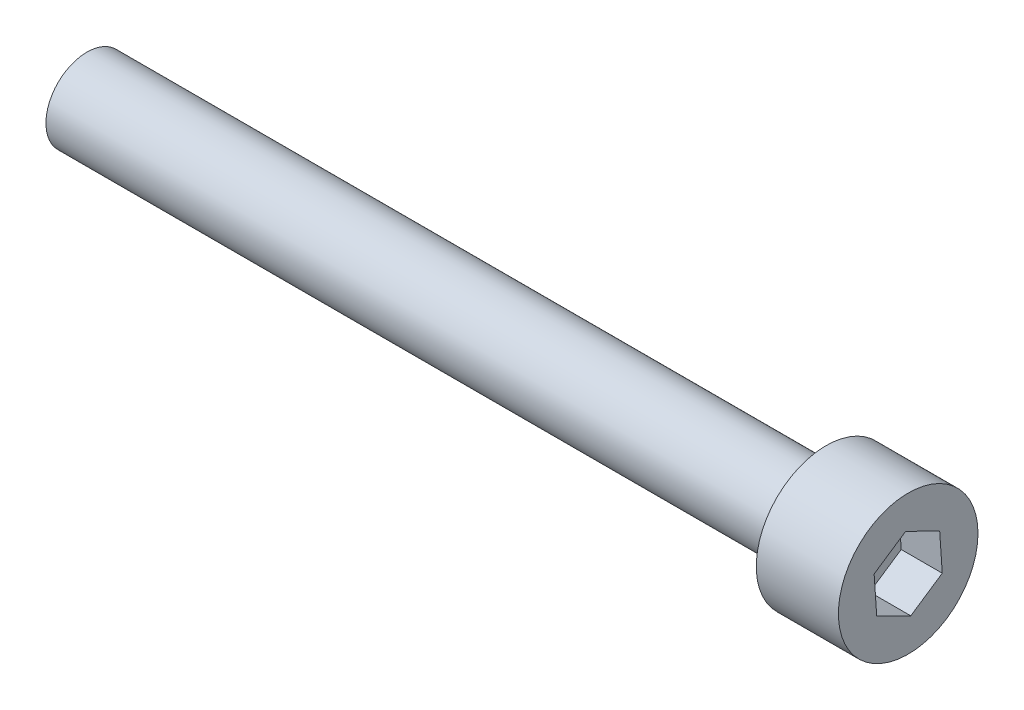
ISO-10303-21;
HEADER;
FILE_DESCRIPTION(('STEP AP214'),'2;1');
FILE_NAME('part.step','',(''),(''),'','','');
FILE_SCHEMA(('AUTOMOTIVE_DESIGN { 1 0 10303 214 1 1 1 1 }'));
ENDSEC;
DATA;
#1=APPLICATION_CONTEXT('core data for automotive mechanical design processes');
#2=APPLICATION_PROTOCOL_DEFINITION('international standard','automotive_design',2000,#1);
#3=PRODUCT_CONTEXT('',#1,'mechanical');
#4=PRODUCT('Part','Part','',(#3));
#5=PRODUCT_RELATED_PRODUCT_CATEGORY('part','',(#4));
#6=PRODUCT_DEFINITION_FORMATION('','',#4);
#7=PRODUCT_DEFINITION_CONTEXT('part definition',#1,'design');
#8=PRODUCT_DEFINITION('design','',#6,#7);
#9=PRODUCT_DEFINITION_SHAPE('','',#8);
#10=(LENGTH_UNIT() NAMED_UNIT(*) SI_UNIT(.MILLI.,.METRE.));
#11=(NAMED_UNIT(*) PLANE_ANGLE_UNIT() SI_UNIT($,.RADIAN.));
#12=(NAMED_UNIT(*) SI_UNIT($,.STERADIAN.) SOLID_ANGLE_UNIT());
#13=UNCERTAINTY_MEASURE_WITH_UNIT(LENGTH_MEASURE(1.E-05),#10,'distance_accuracy_value','');
#14=(GEOMETRIC_REPRESENTATION_CONTEXT(3) GLOBAL_UNCERTAINTY_ASSIGNED_CONTEXT((#13)) GLOBAL_UNIT_ASSIGNED_CONTEXT((#10,
#11,#12)) REPRESENTATION_CONTEXT('',''));
#15=CARTESIAN_POINT('',(0.,0.,0.));
#16=DIRECTION('',(0.,0.,1.));
#17=DIRECTION('',(1.,0.,0.));
#18=AXIS2_PLACEMENT_3D('',#15,#16,#17);
#19=CARTESIAN_POINT('',(0.,0.,0.));
#20=DIRECTION('',(1.,0.,0.));
#21=DIRECTION('',(0.,0.,-1.));
#22=AXIS2_PLACEMENT_3D('',#19,#20,#21);
#23=PLANE('',#22);
#24=DIRECTION('',(0.,0.557571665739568,-0.83012880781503));
#25=VECTOR('',#24,1.);
#26=CARTESIAN_POINT('',(0.,-2.30408591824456,-0.156593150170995));
#27=LINE('',#26,#25);
#28=CARTESIAN_POINT('',(0.,-2.30408591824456,-0.156593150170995));
#29=VERTEX_POINT('',#28);
#30=CARTESIAN_POINT('',(0.,-1.01642931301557,-2.07369351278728));
#31=VERTEX_POINT('',#30);
#32=EDGE_CURVE('E46',#29,#31,#27,.T.);
#33=ORIENTED_EDGE('',*,*,#32,.F.);
#34=DIRECTION('',(0.,-0.440126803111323,-0.897935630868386));
#35=VECTOR('',#34,1.);
#36=CARTESIAN_POINT('',(0.,-1.28765660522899,1.91710036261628));
#37=LINE('',#36,#35);
#38=CARTESIAN_POINT('',(0.,-1.28765660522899,1.91710036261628));
#39=VERTEX_POINT('',#38);
#40=EDGE_CURVE('E129',#39,#29,#37,.T.);
#41=ORIENTED_EDGE('',*,*,#40,.F.);
#42=DIRECTION('',(0.,-0.99769846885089,-0.067806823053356));
#43=VECTOR('',#42,1.);
#44=CARTESIAN_POINT('',(0.,1.01642931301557,2.07369351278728));
#45=LINE('',#44,#43);
#46=CARTESIAN_POINT('',(0.,1.01642931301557,2.07369351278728));
#47=VERTEX_POINT('',#46);
#48=EDGE_CURVE('E127',#47,#39,#45,.T.);
#49=ORIENTED_EDGE('',*,*,#48,.F.);
#50=DIRECTION('',(0.,-0.557571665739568,0.83012880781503));
#51=VECTOR('',#50,1.);
#52=CARTESIAN_POINT('',(0.,2.30408591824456,0.156593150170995));
#53=LINE('',#52,#51);
#54=CARTESIAN_POINT('',(0.,2.30408591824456,0.156593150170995));
#55=VERTEX_POINT('',#54);
#56=EDGE_CURVE('E94',#55,#47,#53,.T.);
#57=ORIENTED_EDGE('',*,*,#56,.F.);
#58=DIRECTION('',(0.,0.440126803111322,0.897935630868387));
#59=VECTOR('',#58,1.);
#60=CARTESIAN_POINT('',(0.,1.28765660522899,-1.91710036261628));
#61=LINE('',#60,#59);
#62=CARTESIAN_POINT('',(0.,1.28765660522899,-1.91710036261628));
#63=VERTEX_POINT('',#62);
#64=EDGE_CURVE('E123',#63,#55,#61,.T.);
#65=ORIENTED_EDGE('',*,*,#64,.F.);
#66=DIRECTION('',(0.,0.99769846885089,0.067806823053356));
#67=VECTOR('',#66,1.);
#68=CARTESIAN_POINT('',(0.,-1.01642931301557,-2.07369351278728));
#69=LINE('',#68,#67);
#70=EDGE_CURVE('E120',#31,#63,#69,.T.);
#71=ORIENTED_EDGE('',*,*,#70,.F.);
#72=EDGE_LOOP('',(#33,#41,#49,#57,#65,#71));
#73=FACE_BOUND('',#72,.T.);
#74=CARTESIAN_POINT('',(0.,0.,0.));
#75=DIRECTION('',(1.,0.,0.));
#76=DIRECTION('',(0.,0.,-1.));
#77=AXIS2_PLACEMENT_3D('',#74,#75,#76);
#78=CIRCLE('',#77,4.25);
#79=CARTESIAN_POINT('',(0.,0.,-4.25));
#80=VERTEX_POINT('',#79);
#81=EDGE_CURVE('E11',#80,#80,#78,.T.);
#82=ORIENTED_EDGE('',*,*,#81,.T.);
#83=EDGE_LOOP('',(#82));
#84=FACE_BOUND('',#83,.T.);
#85=ADVANCED_FACE('F32',(#73,#84),#23,.T.);
#86=CARTESIAN_POINT('',(0.,0.,0.));
#87=DIRECTION('',(1.,0.,0.));
#88=DIRECTION('',(0.,0.,-1.));
#89=AXIS2_PLACEMENT_3D('',#86,#87,#88);
#90=CYLINDRICAL_SURFACE('',#89,4.25);
#91=CARTESIAN_POINT('',(-5.,0.,0.));
#92=DIRECTION('',(1.,0.,0.));
#93=DIRECTION('',(0.,0.,-1.));
#94=AXIS2_PLACEMENT_3D('',#91,#92,#93);
#95=CIRCLE('',#94,4.25);
#96=CARTESIAN_POINT('',(-5.,0.,-4.25));
#97=VERTEX_POINT('',#96);
#98=EDGE_CURVE('E39',#97,#97,#95,.T.);
#99=ORIENTED_EDGE('',*,*,#98,.T.);
#100=EDGE_LOOP('',(#99));
#101=FACE_BOUND('',#100,.T.);
#102=ORIENTED_EDGE('',*,*,#81,.F.);
#103=EDGE_LOOP('',(#102));
#104=FACE_BOUND('',#103,.T.);
#105=ADVANCED_FACE('F146',(#101,#104),#90,.T.);
#106=CARTESIAN_POINT('',(-5.,4.25,0.));
#107=DIRECTION('',(-1.,0.,0.));
#108=DIRECTION('',(0.,0.,1.));
#109=AXIS2_PLACEMENT_3D('',#106,#107,#108);
#110=PLANE('',#109);
#111=CARTESIAN_POINT('',(-5.,0.,0.));
#112=DIRECTION('',(1.,0.,0.));
#113=DIRECTION('',(0.,0.,-1.));
#114=AXIS2_PLACEMENT_3D('',#111,#112,#113);
#115=CIRCLE('',#114,2.5);
#116=CARTESIAN_POINT('',(-5.,0.,-2.5));
#117=VERTEX_POINT('',#116);
#118=EDGE_CURVE('E141',#117,#117,#115,.T.);
#119=ORIENTED_EDGE('',*,*,#118,.T.);
#120=EDGE_LOOP('',(#119));
#121=FACE_BOUND('',#120,.T.);
#122=ORIENTED_EDGE('',*,*,#98,.F.);
#123=EDGE_LOOP('',(#122));
#124=FACE_BOUND('',#123,.T.);
#125=ADVANCED_FACE('F149',(#121,#124),#110,.T.);
#126=CARTESIAN_POINT('',(0.,0.,0.));
#127=DIRECTION('',(1.,0.,0.));
#128=DIRECTION('',(0.,0.,-1.));
#129=AXIS2_PLACEMENT_3D('',#126,#127,#128);
#130=CYLINDRICAL_SURFACE('',#129,2.5);
#131=CARTESIAN_POINT('',(-50.,0.,0.));
#132=DIRECTION('',(1.,0.,0.));
#133=DIRECTION('',(0.,0.,-1.));
#134=AXIS2_PLACEMENT_3D('',#131,#132,#133);
#135=CIRCLE('',#134,2.49999999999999);
#136=CARTESIAN_POINT('',(-50.,0.,-2.49999999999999));
#137=VERTEX_POINT('',#136);
#138=EDGE_CURVE('E133',#137,#137,#135,.T.);
#139=ORIENTED_EDGE('',*,*,#138,.T.);
#140=EDGE_LOOP('',(#139));
#141=FACE_BOUND('',#140,.T.);
#142=ORIENTED_EDGE('',*,*,#118,.F.);
#143=EDGE_LOOP('',(#142));
#144=FACE_BOUND('',#143,.T.);
#145=ADVANCED_FACE('F151',(#141,#144),#130,.T.);
#146=CARTESIAN_POINT('',(-50.,2.49999999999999,0.));
#147=DIRECTION('',(-1.,0.,0.));
#148=DIRECTION('',(0.,0.,1.));
#149=AXIS2_PLACEMENT_3D('',#146,#147,#148);
#150=PLANE('',#149);
#151=ORIENTED_EDGE('',*,*,#138,.F.);
#152=EDGE_LOOP('',(#151));
#153=FACE_BOUND('',#152,.T.);
#154=ADVANCED_FACE('F158',(#153),#150,.T.);
#155=CARTESIAN_POINT('',(-2.5,-2.30408591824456,-0.156593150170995));
#156=DIRECTION('',(0.,-0.83012880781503,-0.557571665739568));
#157=DIRECTION('',(0.,0.557571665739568,-0.83012880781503));
#158=AXIS2_PLACEMENT_3D('',#155,#156,#157);
#159=PLANE('',#158);
#160=ORIENTED_EDGE('',*,*,#32,.T.);
#161=DIRECTION('',(1.,0.,0.));
#162=VECTOR('',#161,1.);
#163=CARTESIAN_POINT('',(-2.5,-1.01642931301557,-2.07369351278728));
#164=LINE('',#163,#162);
#165=CARTESIAN_POINT('',(-2.5,-1.01642931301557,-2.07369351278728));
#166=VERTEX_POINT('',#165);
#167=EDGE_CURVE('E76',#166,#31,#164,.T.);
#168=ORIENTED_EDGE('',*,*,#167,.F.);
#169=DIRECTION('',(0.,0.557571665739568,-0.83012880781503));
#170=VECTOR('',#169,1.);
#171=CARTESIAN_POINT('',(-2.5,-2.30408591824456,-0.156593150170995));
#172=LINE('',#171,#170);
#173=CARTESIAN_POINT('',(-2.5,-2.30408591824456,-0.156593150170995));
#174=VERTEX_POINT('',#173);
#175=EDGE_CURVE('E131',#174,#166,#172,.T.);
#176=ORIENTED_EDGE('',*,*,#175,.F.);
#177=DIRECTION('',(1.,0.,0.));
#178=VECTOR('',#177,1.);
#179=CARTESIAN_POINT('',(-2.5,-2.30408591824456,-0.156593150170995));
#180=LINE('',#179,#178);
#181=EDGE_CURVE('E54',#174,#29,#180,.T.);
#182=ORIENTED_EDGE('',*,*,#181,.T.);
#183=EDGE_LOOP('',(#160,#168,#176,#182));
#184=FACE_BOUND('',#183,.T.);
#185=ADVANCED_FACE('F173',(#184),#159,.F.);
#186=CARTESIAN_POINT('',(-2.5,-1.28765660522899,1.91710036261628));
#187=DIRECTION('',(0.,-0.897935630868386,0.440126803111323));
#188=DIRECTION('',(0.,-0.440126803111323,-0.897935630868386));
#189=AXIS2_PLACEMENT_3D('',#186,#187,#188);
#190=PLANE('',#189);
#191=ORIENTED_EDGE('',*,*,#40,.T.);
#192=ORIENTED_EDGE('',*,*,#181,.F.);
#193=DIRECTION('',(0.,-0.440126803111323,-0.897935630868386));
#194=VECTOR('',#193,1.);
#195=CARTESIAN_POINT('',(-2.5,-1.28765660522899,1.91710036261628));
#196=LINE('',#195,#194);
#197=CARTESIAN_POINT('',(-2.5,-1.28765660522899,1.91710036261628));
#198=VERTEX_POINT('',#197);
#199=EDGE_CURVE('E106',#198,#174,#196,.T.);
#200=ORIENTED_EDGE('',*,*,#199,.F.);
#201=DIRECTION('',(1.,0.,0.));
#202=VECTOR('',#201,1.);
#203=CARTESIAN_POINT('',(-2.5,-1.28765660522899,1.91710036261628));
#204=LINE('',#203,#202);
#205=EDGE_CURVE('E98',#198,#39,#204,.T.);
#206=ORIENTED_EDGE('',*,*,#205,.T.);
#207=EDGE_LOOP('',(#191,#192,#200,#206));
#208=FACE_BOUND('',#207,.T.);
#209=ADVANCED_FACE('F175',(#208),#190,.F.);
#210=CARTESIAN_POINT('',(-2.5,1.01642931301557,2.07369351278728));
#211=DIRECTION('',(0.,-0.067806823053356,0.99769846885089));
#212=DIRECTION('',(0.,-0.99769846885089,-0.067806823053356));
#213=AXIS2_PLACEMENT_3D('',#210,#211,#212);
#214=PLANE('',#213);
#215=ORIENTED_EDGE('',*,*,#48,.T.);
#216=ORIENTED_EDGE('',*,*,#205,.F.);
#217=DIRECTION('',(0.,-0.99769846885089,-0.067806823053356));
#218=VECTOR('',#217,1.);
#219=CARTESIAN_POINT('',(-2.5,1.01642931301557,2.07369351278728));
#220=LINE('',#219,#218);
#221=CARTESIAN_POINT('',(-2.5,1.01642931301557,2.07369351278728));
#222=VERTEX_POINT('',#221);
#223=EDGE_CURVE('E102',#222,#198,#220,.T.);
#224=ORIENTED_EDGE('',*,*,#223,.F.);
#225=DIRECTION('',(1.,0.,0.));
#226=VECTOR('',#225,1.);
#227=CARTESIAN_POINT('',(-2.5,1.01642931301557,2.07369351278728));
#228=LINE('',#227,#226);
#229=EDGE_CURVE('E87',#222,#47,#228,.T.);
#230=ORIENTED_EDGE('',*,*,#229,.T.);
#231=EDGE_LOOP('',(#215,#216,#224,#230));
#232=FACE_BOUND('',#231,.T.);
#233=ADVANCED_FACE('F103',(#232),#214,.F.);
#234=CARTESIAN_POINT('',(-2.5,2.30408591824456,0.156593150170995));
#235=DIRECTION('',(0.,0.83012880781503,0.557571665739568));
#236=DIRECTION('',(0.,-0.557571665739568,0.83012880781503));
#237=AXIS2_PLACEMENT_3D('',#234,#235,#236);
#238=PLANE('',#237);
#239=ORIENTED_EDGE('',*,*,#56,.T.);
#240=ORIENTED_EDGE('',*,*,#229,.F.);
#241=DIRECTION('',(0.,-0.557571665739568,0.83012880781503));
#242=VECTOR('',#241,1.);
#243=CARTESIAN_POINT('',(-2.5,2.30408591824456,0.156593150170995));
#244=LINE('',#243,#242);
#245=CARTESIAN_POINT('',(-2.5,2.30408591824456,0.156593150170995));
#246=VERTEX_POINT('',#245);
#247=EDGE_CURVE('E91',#246,#222,#244,.T.);
#248=ORIENTED_EDGE('',*,*,#247,.F.);
#249=DIRECTION('',(1.,0.,0.));
#250=VECTOR('',#249,1.);
#251=CARTESIAN_POINT('',(-2.5,2.30408591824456,0.156593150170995));
#252=LINE('',#251,#250);
#253=EDGE_CURVE('E99',#246,#55,#252,.T.);
#254=ORIENTED_EDGE('',*,*,#253,.T.);
#255=EDGE_LOOP('',(#239,#240,#248,#254));
#256=FACE_BOUND('',#255,.T.);
#257=ADVANCED_FACE('F89',(#256),#238,.F.);
#258=CARTESIAN_POINT('',(-2.5,1.28765660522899,-1.91710036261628));
#259=DIRECTION('',(0.,0.897935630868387,-0.440126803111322));
#260=DIRECTION('',(0.,0.440126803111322,0.897935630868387));
#261=AXIS2_PLACEMENT_3D('',#258,#259,#260);
#262=PLANE('',#261);
#263=ORIENTED_EDGE('',*,*,#64,.T.);
#264=ORIENTED_EDGE('',*,*,#253,.F.);
#265=DIRECTION('',(0.,0.440126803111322,0.897935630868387));
#266=VECTOR('',#265,1.);
#267=CARTESIAN_POINT('',(-2.5,1.28765660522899,-1.91710036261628));
#268=LINE('',#267,#266);
#269=CARTESIAN_POINT('',(-2.5,1.28765660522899,-1.91710036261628));
#270=VERTEX_POINT('',#269);
#271=EDGE_CURVE('E112',#270,#246,#268,.T.);
#272=ORIENTED_EDGE('',*,*,#271,.F.);
#273=DIRECTION('',(1.,0.,0.));
#274=VECTOR('',#273,1.);
#275=CARTESIAN_POINT('',(-2.5,1.28765660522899,-1.91710036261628));
#276=LINE('',#275,#274);
#277=EDGE_CURVE('E136',#270,#63,#276,.T.);
#278=ORIENTED_EDGE('',*,*,#277,.T.);
#279=EDGE_LOOP('',(#263,#264,#272,#278));
#280=FACE_BOUND('',#279,.T.);
#281=ADVANCED_FACE('F187',(#280),#262,.F.);
#282=CARTESIAN_POINT('',(-2.5,-1.01642931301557,-2.07369351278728));
#283=DIRECTION('',(0.,0.067806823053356,-0.99769846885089));
#284=DIRECTION('',(0.,0.99769846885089,0.067806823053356));
#285=AXIS2_PLACEMENT_3D('',#282,#283,#284);
#286=PLANE('',#285);
#287=ORIENTED_EDGE('',*,*,#70,.T.);
#288=ORIENTED_EDGE('',*,*,#277,.F.);
#289=DIRECTION('',(0.,0.99769846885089,0.067806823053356));
#290=VECTOR('',#289,1.);
#291=CARTESIAN_POINT('',(-2.5,-1.01642931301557,-2.07369351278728));
#292=LINE('',#291,#290);
#293=EDGE_CURVE('E114',#166,#270,#292,.T.);
#294=ORIENTED_EDGE('',*,*,#293,.F.);
#295=ORIENTED_EDGE('',*,*,#167,.T.);
#296=EDGE_LOOP('',(#287,#288,#294,#295));
#297=FACE_BOUND('',#296,.T.);
#298=ADVANCED_FACE('F171',(#297),#286,.F.);
#299=CARTESIAN_POINT('',(-2.5,-1.01642931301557,-2.07369351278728));
#300=DIRECTION('',(1.,0.,0.));
#301=DIRECTION('',(0.,0.,-1.));
#302=AXIS2_PLACEMENT_3D('',#299,#300,#301);
#303=PLANE('',#302);
#304=ORIENTED_EDGE('',*,*,#175,.T.);
#305=ORIENTED_EDGE('',*,*,#293,.T.);
#306=ORIENTED_EDGE('',*,*,#271,.T.);
#307=ORIENTED_EDGE('',*,*,#247,.T.);
#308=ORIENTED_EDGE('',*,*,#223,.T.);
#309=ORIENTED_EDGE('',*,*,#199,.T.);
#310=EDGE_LOOP('',(#304,#305,#306,#307,#308,#309));
#311=FACE_BOUND('',#310,.T.);
#312=ADVANCED_FACE('F109',(#311),#303,.T.);
#313=CLOSED_SHELL('',(#85,#105,#125,#145,#154,#185,#209,#233,#257,#281,#298,#312));
#314=MANIFOLD_SOLID_BREP('B2',#313);
#315=ADVANCED_BREP_SHAPE_REPRESENTATION('',(#18,#314),#14);
#316=SHAPE_DEFINITION_REPRESENTATION(#9,#315);
ENDSEC;
END-ISO-10303-21;
